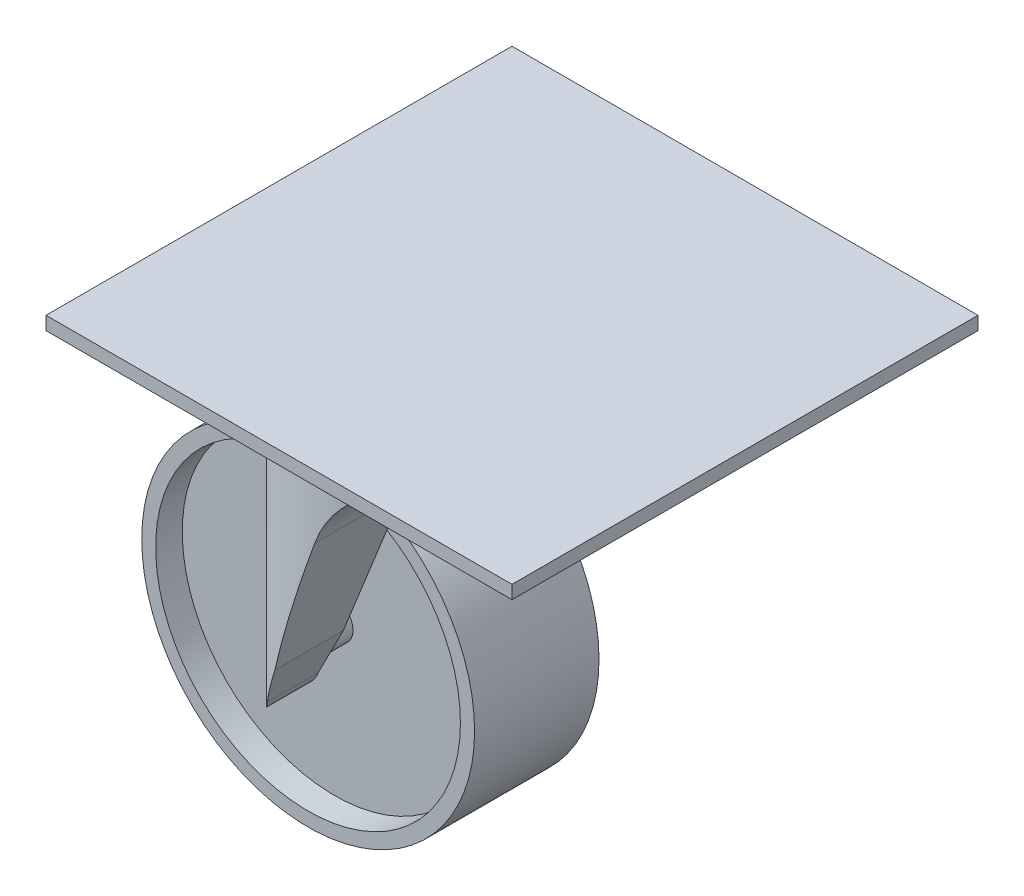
ISO-10303-21;
HEADER;
FILE_DESCRIPTION(('STEP AP214'),'2;1');
FILE_NAME('part.step','',(''),(''),'','','');
FILE_SCHEMA(('AUTOMOTIVE_DESIGN { 1 0 10303 214 1 1 1 1 }'));
ENDSEC;
DATA;
#1=APPLICATION_CONTEXT('core data for automotive mechanical design processes');
#2=APPLICATION_PROTOCOL_DEFINITION('international standard','automotive_design',2000,#1);
#3=PRODUCT_CONTEXT('',#1,'mechanical');
#4=PRODUCT('Part','Part','',(#3));
#5=PRODUCT_RELATED_PRODUCT_CATEGORY('part','',(#4));
#6=PRODUCT_DEFINITION_FORMATION('','',#4);
#7=PRODUCT_DEFINITION_CONTEXT('part definition',#1,'design');
#8=PRODUCT_DEFINITION('design','',#6,#7);
#9=PRODUCT_DEFINITION_SHAPE('','',#8);
#10=(LENGTH_UNIT() NAMED_UNIT(*) SI_UNIT(.MILLI.,.METRE.));
#11=(NAMED_UNIT(*) PLANE_ANGLE_UNIT() SI_UNIT($,.RADIAN.));
#12=(NAMED_UNIT(*) SI_UNIT($,.STERADIAN.) SOLID_ANGLE_UNIT());
#13=UNCERTAINTY_MEASURE_WITH_UNIT(LENGTH_MEASURE(1.E-05),#10,'distance_accuracy_value','');
#14=(GEOMETRIC_REPRESENTATION_CONTEXT(3) GLOBAL_UNCERTAINTY_ASSIGNED_CONTEXT((#13)) GLOBAL_UNIT_ASSIGNED_CONTEXT((#10,
#11,#12)) REPRESENTATION_CONTEXT('',''));
#15=CARTESIAN_POINT('',(0.,0.,0.));
#16=DIRECTION('',(0.,0.,1.));
#17=DIRECTION('',(1.,0.,0.));
#18=AXIS2_PLACEMENT_3D('',#15,#16,#17);
#19=CARTESIAN_POINT('',(35.,-4.63640510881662,-10.9841766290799));
#20=DIRECTION('',(0.,0.,-1.));
#21=DIRECTION('',(0.,1.,0.));
#22=AXIS2_PLACEMENT_3D('',#19,#20,#21);
#23=PLANE('',#22);
#24=DIRECTION('',(0.,1.,0.));
#25=VECTOR('',#24,1.);
#26=CARTESIAN_POINT('',(6.39555851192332,-25.,-10.9841766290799));
#27=LINE('',#26,#25);
#28=CARTESIAN_POINT('',(6.39555851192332,-22.4023650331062,-10.9841766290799));
#29=VERTEX_POINT('',#28);
#30=CARTESIAN_POINT('',(6.39555851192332,-21.486709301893,-10.9841766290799));
#31=VERTEX_POINT('',#30);
#32=EDGE_CURVE('E185',#29,#31,#27,.T.);
#33=ORIENTED_EDGE('',*,*,#32,.T.);
#34=CARTESIAN_POINT('',(7.69587725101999,-21.9445371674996,-10.9841766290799));
#35=DIRECTION('',(0.,0.,-1.));
#36=DIRECTION('',(0.,1.,0.));
#37=AXIS2_PLACEMENT_3D('',#34,#35,#36);
#38=CIRCLE('',#37,1.37856272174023);
#39=EDGE_CURVE('E191',#29,#31,#38,.T.);
#40=ORIENTED_EDGE('',*,*,#39,.F.);
#41=EDGE_LOOP('',(#33,#40));
#42=FACE_BOUND('',#41,.T.);
#43=ADVANCED_FACE('F41',(#42),#23,.F.);
#44=CARTESIAN_POINT('',(7.70636639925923,-21.935380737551,24.3711624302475));
#45=DIRECTION('',(0.,0.,-1.));
#46=DIRECTION('',(-1.,0.,0.));
#47=AXIS2_PLACEMENT_3D('',#44,#45,#46);
#48=CYLINDRICAL_SURFACE('',#47,12.5);
#49=CARTESIAN_POINT('',(7.70636639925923,-21.935380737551,-21.3300622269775));
#50=DIRECTION('',(0.,0.,-1.));
#51=DIRECTION('',(-1.,0.,0.));
#52=AXIS2_PLACEMENT_3D('',#49,#50,#51);
#53=CIRCLE('',#52,12.5);
#54=CARTESIAN_POINT('',(-4.79363360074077,-21.935380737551,-21.3300622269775));
#55=VERTEX_POINT('',#54);
#56=EDGE_CURVE('E293',#55,#55,#53,.T.);
#57=ORIENTED_EDGE('',*,*,#56,.F.);
#58=EDGE_LOOP('',(#57));
#59=FACE_BOUND('',#58,.T.);
#60=CARTESIAN_POINT('',(7.70636639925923,-21.935380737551,-11.9841766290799));
#61=DIRECTION('',(0.,0.,1.));
#62=DIRECTION('',(1.,0.,0.));
#63=AXIS2_PLACEMENT_3D('',#60,#61,#62);
#64=CIRCLE('',#63,12.5);
#65=CARTESIAN_POINT('',(20.2063663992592,-21.935380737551,-11.9841766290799));
#66=VERTEX_POINT('',#65);
#67=EDGE_CURVE('E720',#66,#66,#64,.T.);
#68=ORIENTED_EDGE('',*,*,#67,.F.);
#69=EDGE_LOOP('',(#68));
#70=FACE_BOUND('',#69,.T.);
#71=ADVANCED_FACE('F379',(#59,#70),#48,.T.);
#72=CARTESIAN_POINT('',(17.5,-25.,-16.7236347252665));
#73=DIRECTION('',(0.,1.,0.));
#74=DIRECTION('',(0.,0.,1.));
#75=AXIS2_PLACEMENT_3D('',#72,#73,#74);
#76=CYLINDRICAL_SURFACE('',#75,12.5);
#77=CARTESIAN_POINT('',(17.5,0.,-16.7236347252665));
#78=DIRECTION('',(0.,-1.,0.));
#79=DIRECTION('',(0.,0.,-1.));
#80=AXIS2_PLACEMENT_3D('',#77,#78,#79);
#81=CIRCLE('',#80,12.5);
#82=CARTESIAN_POINT('',(17.5,0.,-29.2236347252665));
#83=VERTEX_POINT('',#82);
#84=EDGE_CURVE('E221',#83,#83,#81,.T.);
#85=ORIENTED_EDGE('',*,*,#84,.T.);
#86=EDGE_LOOP('',(#85));
#87=FACE_BOUND('',#86,.T.);
#88=CARTESIAN_POINT('',(6.39555851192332,-23.9530585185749,-10.9841766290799));
#89=VERTEX_POINT('',#88);
#90=EDGE_CURVE('E174',#89,#29,#27,.T.);
#91=ORIENTED_EDGE('',*,*,#90,.F.);
#92=CARTESIAN_POINT('',(5.65509512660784,-22.1428101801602,-12.7301114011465));
#93=CARTESIAN_POINT('',(5.65034982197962,-22.1776052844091,-12.7441965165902));
#94=CARTESIAN_POINT('',(5.64645610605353,-22.2136446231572,-12.7558195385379));
#95=CARTESIAN_POINT('',(5.64063202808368,-22.287154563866,-12.7732549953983));
#96=CARTESIAN_POINT('',(5.63869746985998,-22.3246219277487,-12.7790798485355));
#97=CARTESIAN_POINT('',(5.63702416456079,-22.4003228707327,-12.7841160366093));
#98=CARTESIAN_POINT('',(5.63729913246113,-22.4385597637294,-12.7832860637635));
#99=CARTESIAN_POINT('',(5.64003305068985,-22.5141627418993,-12.7750651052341));
#100=CARTESIAN_POINT('',(5.64248988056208,-22.5515296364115,-12.7676804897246));
#101=CARTESIAN_POINT('',(5.6500806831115,-22.6326762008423,-12.744994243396));
#102=CARTESIAN_POINT('',(5.65569225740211,-22.6760095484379,-12.7282862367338));
#103=CARTESIAN_POINT('',(5.66914659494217,-22.759386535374,-12.6886192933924));
#104=CARTESIAN_POINT('',(5.67699711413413,-22.7994181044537,-12.6656386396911));
#105=CARTESIAN_POINT('',(5.7010548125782,-22.9057677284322,-12.5960365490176));
#106=CARTESIAN_POINT('',(5.71904544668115,-22.9686238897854,-12.5448262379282));
#107=CARTESIAN_POINT('',(5.75848533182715,-23.086381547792,-12.4352452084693));
#108=CARTESIAN_POINT('',(5.77994432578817,-23.1412597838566,-12.3768544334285));
#109=CARTESIAN_POINT('',(5.83533601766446,-23.267387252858,-12.2298472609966));
#110=CARTESIAN_POINT('',(5.87065397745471,-23.3354742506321,-12.1390658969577));
#111=CARTESIAN_POINT('',(5.94566400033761,-23.4628520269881,-11.9531574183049));
#112=CARTESIAN_POINT('',(5.98536443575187,-23.5221254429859,-11.858022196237));
#113=CARTESIAN_POINT('',(6.06887979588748,-23.6338773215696,-11.6649189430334));
#114=CARTESIAN_POINT('',(6.11271351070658,-23.6863218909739,-11.5669395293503));
#115=CARTESIAN_POINT('',(6.20408261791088,-23.785047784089,-11.369751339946));
#116=CARTESIAN_POINT('',(6.25161526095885,-23.831333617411,-11.2705435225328));
#117=CARTESIAN_POINT('',(6.3757513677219,-23.940737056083,-11.0201792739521));
#118=CARTESIAN_POINT('',(6.45471357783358,-24.0002377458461,-10.8685965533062));
#119=CARTESIAN_POINT('',(6.62082441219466,-24.1068711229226,-10.5654316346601));
#120=CARTESIAN_POINT('',(6.70797901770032,-24.1539946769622,-10.4138495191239));
#121=CARTESIAN_POINT('',(6.88992106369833,-24.2350099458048,-10.112502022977));
#122=CARTESIAN_POINT('',(6.98467891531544,-24.2689502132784,-9.96273198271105));
#123=CARTESIAN_POINT('',(7.18169671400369,-24.3223697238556,-9.66570627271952));
#124=CARTESIAN_POINT('',(7.28395049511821,-24.3418607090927,-9.51844865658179));
#125=CARTESIAN_POINT('',(7.51498671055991,-24.3663148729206,-9.2006792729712));
#126=CARTESIAN_POINT('',(7.64517851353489,-24.367925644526,-9.03090205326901));
#127=CARTESIAN_POINT('',(7.91311886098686,-24.3427019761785,-8.6994911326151));
#128=CARTESIAN_POINT('',(8.05085827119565,-24.3159012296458,-8.53784802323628));
#129=CARTESIAN_POINT('',(8.29412407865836,-24.2384101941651,-8.26631412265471));
#130=CARTESIAN_POINT('',(8.39900057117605,-24.1954626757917,-8.15366318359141));
#131=CARTESIAN_POINT('',(8.60702861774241,-24.086687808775,-7.93800155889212));
#132=CARTESIAN_POINT('',(8.71018188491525,-24.0208847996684,-7.83498076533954));
#133=CARTESIAN_POINT('',(8.88382115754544,-23.8837020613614,-7.66702557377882));
#134=CARTESIAN_POINT('',(8.9559136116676,-23.818054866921,-7.59908980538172));
#135=CARTESIAN_POINT('',(9.09282397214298,-23.6719896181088,-7.4727965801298));
#136=CARTESIAN_POINT('',(9.15766472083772,-23.591620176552,-7.41440876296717));
#137=CARTESIAN_POINT('',(9.26399197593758,-23.4346674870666,-7.32033034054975));
#138=CARTESIAN_POINT('',(9.30752688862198,-23.3608060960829,-7.28244660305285));
#139=CARTESIAN_POINT('',(9.36623216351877,-23.2436561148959,-7.23192803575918));
#140=CARTESIAN_POINT('',(9.38475597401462,-23.2033891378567,-7.21609398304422));
#141=CARTESIAN_POINT('',(9.41929409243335,-23.120937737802,-7.18672205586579));
#142=CARTESIAN_POINT('',(9.43530601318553,-23.0787515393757,-7.1731863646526));
#143=CARTESIAN_POINT('',(9.4499291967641,-23.0357123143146,-7.16087570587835));
#144=B_SPLINE_CURVE_WITH_KNOTS('',3,(#92,#93,#94,#95,#96,#97,#98,#99,#100,#101,#102,#103,#104,
#105,#106,#107,#108,#109,#110,#111,#112,#113,#114,#115,#116,#117,#118,#119,#120,#121,#122,#123,
#124,#125,#126,#127,#128,#129,#130,#131,#132,#133,#134,#135,#136,#137,#138,#139,#140,#141,#142,
#143),.UNSPECIFIED.,.F.,.F.,(4,2,2,2,2,2,2,2,2,2,2,2,2,2,2,2,2,2,2,2,2,2,2,2,2,4),(0.,
0.113592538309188,0.226941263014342,0.340994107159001,0.454936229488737,0.594487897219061,
0.734528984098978,0.982273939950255,1.23072733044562,1.58645581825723,1.94287605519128,
2.30100283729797,2.6588659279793,3.20113425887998,3.74380162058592,4.2844510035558,
4.82466054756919,5.46475129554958,6.10408380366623,6.58195160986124,7.05931207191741,
7.41456032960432,7.768656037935,8.04871541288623,8.18976937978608,8.33095659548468),.UNSPECIFIED.);
#145=CARTESIAN_POINT('',(9.4499291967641,-23.0357123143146,-7.16087570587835));
#146=VERTEX_POINT('',#145);
#147=EDGE_CURVE('E339',#89,#146,#144,.T.);
#148=ORIENTED_EDGE('',*,*,#147,.T.);
#149=CARTESIAN_POINT('',(17.5,-7.29072089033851,-16.7236347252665));
#150=DIRECTION('',(-0.890374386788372,0.455229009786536,0.));
#151=DIRECTION('',(0.455229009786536,0.890374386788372,0.));
#152=AXIS2_PLACEMENT_3D('',#149,#150,#151);
#153=ELLIPSE('',#152,27.4587070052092,12.5);
#154=CARTESIAN_POINT('',(11.3473462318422,-19.3245878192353,-5.84269489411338));
#155=VERTEX_POINT('',#154);
#156=EDGE_CURVE('E342',#146,#155,#153,.T.);
#157=ORIENTED_EDGE('',*,*,#156,.T.);
#158=CARTESIAN_POINT('',(17.5,-3.9523616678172,-16.7236347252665));
#159=DIRECTION('',(-0.928398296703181,0.371586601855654,0.));
#160=DIRECTION('',(0.371586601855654,0.928398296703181,0.));
#161=AXIS2_PLACEMENT_3D('',#158,#159,#160);
#162=ELLIPSE('',#161,33.63953365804,12.5);
#163=CARTESIAN_POINT('',(15.8546728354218,-8.06316364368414,-4.33239190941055));
#164=VERTEX_POINT('',#163);
#165=EDGE_CURVE('E257',#155,#164,#162,.T.);
#166=ORIENTED_EDGE('',*,*,#165,.T.);
#167=CARTESIAN_POINT('',(15.8546728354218,-8.06316364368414,-4.33239190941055));
#168=CARTESIAN_POINT('',(15.9632554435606,-7.79181231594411,-4.31800944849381));
#169=CARTESIAN_POINT('',(16.0827535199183,-7.52482273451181,-4.30355965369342));
#170=CARTESIAN_POINT('',(16.3428077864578,-7.00109031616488,-4.27661777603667));
#171=CARTESIAN_POINT('',(16.4833711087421,-6.74435098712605,-4.26412635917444));
#172=CARTESIAN_POINT('',(16.7856998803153,-6.24117827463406,-4.24313738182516));
#173=CARTESIAN_POINT('',(16.9475987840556,-5.99482384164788,-4.23466664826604));
#174=CARTESIAN_POINT('',(17.2908042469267,-5.51591240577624,-4.22420609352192));
#175=CARTESIAN_POINT('',(17.4721080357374,-5.28335344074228,-4.22221534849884));
#176=CARTESIAN_POINT('',(17.8536154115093,-4.8327740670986,-4.22717609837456));
#177=CARTESIAN_POINT('',(18.0538910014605,-4.61481488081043,-4.23416303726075));
#178=CARTESIAN_POINT('',(18.4710683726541,-4.1961764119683,-4.25965977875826));
#179=CARTESIAN_POINT('',(18.6879678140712,-3.99549470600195,-4.27816796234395));
#180=CARTESIAN_POINT('',(19.135267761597,-3.61394819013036,-4.32902616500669));
#181=CARTESIAN_POINT('',(19.3655992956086,-3.43299383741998,-4.36131006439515));
#182=CARTESIAN_POINT('',(19.8380385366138,-3.09140233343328,-4.44190474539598));
#183=CARTESIAN_POINT('',(20.0801369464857,-2.93074949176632,-4.49020304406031));
#184=CARTESIAN_POINT('',(20.4511155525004,-2.70507424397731,-4.57631869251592));
#185=CARTESIAN_POINT('',(20.5767536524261,-2.63206116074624,-4.60750017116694));
#186=CARTESIAN_POINT('',(20.829876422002,-2.49157576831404,-4.67460652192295));
#187=CARTESIAN_POINT('',(20.9573614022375,-2.4241044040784,-4.71053220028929));
#188=CARTESIAN_POINT('',(21.0855601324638,-2.35944727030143,-4.74892142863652));
#189=B_SPLINE_CURVE_WITH_KNOTS('',3,(#167,#168,#169,#170,#171,#172,#173,#174,#175,#176,#177,
#178,#179,#180,#181,#182,#183,#184,#185,#186,#187,#188),.UNSPECIFIED.,.F.,.F.,(4,2,2,2,2,2,2,2,
2,2,4),(0.,0.877653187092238,1.75560419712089,2.63933350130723,3.52293680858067,
4.41003933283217,5.29701722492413,6.17978492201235,7.06186612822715,7.50756175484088,
7.95333322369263),.UNSPECIFIED.);
#190=CARTESIAN_POINT('',(21.0855601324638,-2.35944727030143,-4.74892142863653));
#191=VERTEX_POINT('',#190);
#192=EDGE_CURVE('E248',#164,#191,#189,.T.);
#193=ORIENTED_EDGE('',*,*,#192,.T.);
#194=CARTESIAN_POINT('',(17.5,-2.50402391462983,-16.7236347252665));
#195=DIRECTION('',(-0.0402891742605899,0.999188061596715,0.));
#196=DIRECTION('',(0.999188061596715,0.0402891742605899,0.));
#197=AXIS2_PLACEMENT_3D('',#194,#195,#196);
#198=ELLIPSE('',#197,12.510157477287,12.5);
#199=CARTESIAN_POINT('',(21.0855601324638,-2.35944727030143,-28.6983480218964));
#200=VERTEX_POINT('',#199);
#201=EDGE_CURVE('E224',#191,#200,#198,.T.);
#202=ORIENTED_EDGE('',*,*,#201,.T.);
#203=CARTESIAN_POINT('',(21.0855601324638,-2.35944727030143,-28.6983480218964));
#204=CARTESIAN_POINT('',(20.9677017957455,-2.41889013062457,-28.733640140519));
#205=CARTESIAN_POINT('',(20.8504450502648,-2.480711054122,-28.7668515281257));
#206=CARTESIAN_POINT('',(20.6174534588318,-2.60904972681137,-28.8292541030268));
#207=CARTESIAN_POINT('',(20.5017184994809,-2.67556712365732,-28.8584455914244));
#208=CARTESIAN_POINT('',(20.1574813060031,-2.88194906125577,-28.9401541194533));
#209=CARTESIAN_POINT('',(19.9317059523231,-3.02876439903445,-28.9868763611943));
#210=CARTESIAN_POINT('',(19.4912204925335,-3.33911737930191,-29.0660372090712));
#211=CARTESIAN_POINT('',(19.2764586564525,-3.50256347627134,-29.0985492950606));
#212=CARTESIAN_POINT('',(18.8587250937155,-3.84572482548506,-29.1513535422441));
#213=CARTESIAN_POINT('',(18.65575488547,-4.02544216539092,-29.1716441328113));
#214=CARTESIAN_POINT('',(18.2638394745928,-4.3993953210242,-29.201819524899));
#215=CARTESIAN_POINT('',(18.0748606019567,-4.5935938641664,-29.211730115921));
#216=CARTESIAN_POINT('',(17.7117232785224,-4.9956174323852,-29.2231619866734));
#217=CARTESIAN_POINT('',(17.5375658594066,-5.20344340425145,-29.2246826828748));
#218=CARTESIAN_POINT('',(17.2051262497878,-5.63148643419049,-29.2212625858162));
#219=CARTESIAN_POINT('',(17.0468503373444,-5.85170833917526,-29.2163192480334));
#220=CARTESIAN_POINT('',(16.7471923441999,-6.30311439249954,-29.2018466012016));
#221=CARTESIAN_POINT('',(16.6058050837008,-6.53429514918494,-29.1923187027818));
#222=CARTESIAN_POINT('',(16.355977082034,-6.97905702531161,-29.1717301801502));
#223=CARTESIAN_POINT('',(16.245617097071,-7.19157800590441,-29.1609746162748));
#224=CARTESIAN_POINT('',(16.0393298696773,-7.62282625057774,-29.1384272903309));
#225=CARTESIAN_POINT('',(15.9433683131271,-7.84153723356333,-29.1266381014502));
#226=CARTESIAN_POINT('',(15.8546728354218,-8.06316364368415,-29.1148775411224));
#227=B_SPLINE_CURVE_WITH_KNOTS('',3,(#203,#204,#205,#206,#207,#208,#209,#210,#211,#212,#213,
#214,#215,#216,#217,#218,#219,#220,#221,#222,#223,#224,#225,#226),.UNSPECIFIED.,.F.,.F.,(4,2,2,
2,2,2,2,2,2,2,2,4),(0.,0.409830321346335,0.819629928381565,1.63839615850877,2.4528770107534,
3.26746251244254,4.0800193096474,4.89263262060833,5.70556590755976,6.51824922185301,
7.23686619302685,7.9537423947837),.UNSPECIFIED.);
#228=CARTESIAN_POINT('',(15.8546728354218,-8.06316364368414,-29.1148775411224));
#229=VERTEX_POINT('',#228);
#230=EDGE_CURVE('E273',#200,#229,#227,.T.);
#231=ORIENTED_EDGE('',*,*,#230,.T.);
#232=CARTESIAN_POINT('',(11.3473462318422,-19.3245878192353,-27.6045745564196));
#233=VERTEX_POINT('',#232);
#234=EDGE_CURVE('E282',#229,#233,#162,.T.);
#235=ORIENTED_EDGE('',*,*,#234,.T.);
#236=CARTESIAN_POINT('',(9.4499291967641,-23.0357123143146,-26.2863937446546));
#237=VERTEX_POINT('',#236);
#238=EDGE_CURVE('E345',#233,#237,#153,.T.);
#239=ORIENTED_EDGE('',*,*,#238,.T.);
#240=CARTESIAN_POINT('',(9.4499291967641,-23.0357123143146,-26.2863937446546));
#241=CARTESIAN_POINT('',(9.43314192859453,-23.0851382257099,-26.2722611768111));
#242=CARTESIAN_POINT('',(9.41451234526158,-23.1334437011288,-26.256503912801));
#243=CARTESIAN_POINT('',(9.37399189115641,-23.2274753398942,-26.22198738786));
#244=CARTESIAN_POINT('',(9.35210506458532,-23.2732046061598,-26.2032318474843));
#245=CARTESIAN_POINT('',(9.30565593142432,-23.3614774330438,-26.1631079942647));
#246=CARTESIAN_POINT('',(9.28111892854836,-23.4040455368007,-26.141764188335));
#247=CARTESIAN_POINT('',(9.22961114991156,-23.486276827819,-26.0965663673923));
#248=CARTESIAN_POINT('',(9.20263966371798,-23.5259391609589,-26.0727116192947));
#249=CARTESIAN_POINT('',(9.11893591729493,-23.6400075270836,-25.9979705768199));
#250=CARTESIAN_POINT('',(9.05914245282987,-23.7099975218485,-25.9436750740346));
#251=CARTESIAN_POINT('',(8.93408670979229,-23.8380485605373,-25.8276153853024));
#252=CARTESIAN_POINT('',(8.86881070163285,-23.8960783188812,-25.7658322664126));
#253=CARTESIAN_POINT('',(8.69825850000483,-24.0294208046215,-25.6005735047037));
#254=CARTESIAN_POINT('',(8.59074582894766,-24.096659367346,-25.4928709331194));
#255=CARTESIAN_POINT('',(8.37409534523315,-24.2067141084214,-25.2671985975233));
#256=CARTESIAN_POINT('',(8.26495491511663,-24.2494852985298,-25.1492103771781));
#257=CARTESIAN_POINT('',(8.07762521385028,-24.3055046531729,-24.9384473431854));
#258=CARTESIAN_POINT('',(7.99893689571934,-24.3235825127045,-24.8473302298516));
#259=CARTESIAN_POINT('',(7.84353547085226,-24.3497793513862,-24.6619794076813));
#260=CARTESIAN_POINT('',(7.76682330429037,-24.3578936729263,-24.5677442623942));
#261=CARTESIAN_POINT('',(7.61591798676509,-24.3652769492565,-24.3767236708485));
#262=CARTESIAN_POINT('',(7.54172917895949,-24.3645313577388,-24.2799342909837));
#263=CARTESIAN_POINT('',(7.39638711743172,-24.3551102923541,-24.0844669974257));
#264=CARTESIAN_POINT('',(7.32523474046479,-24.3464325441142,-23.985788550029));
#265=CARTESIAN_POINT('',(7.1562209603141,-24.316640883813,-23.7440601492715));
#266=CARTESIAN_POINT('',(7.0600950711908,-24.2917747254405,-23.6002516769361));
#267=CARTESIAN_POINT('',(6.87505933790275,-24.2291160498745,-23.3107572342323));
#268=CARTESIAN_POINT('',(6.78615386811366,-24.1913157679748,-23.1650701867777));
#269=CARTESIAN_POINT('',(6.61581227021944,-24.1038242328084,-22.8728677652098));
#270=CARTESIAN_POINT('',(6.53437812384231,-24.0541298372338,-22.7263521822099));
#271=CARTESIAN_POINT('',(6.37919393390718,-23.94319269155,-22.4337179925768));
#272=CARTESIAN_POINT('',(6.30543894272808,-23.8819574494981,-22.2875991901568));
#273=CARTESIAN_POINT('',(6.2009804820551,-23.7811101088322,-22.0704620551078));
#274=CARTESIAN_POINT('',(6.16730454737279,-23.7461425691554,-21.9986878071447));
#275=CARTESIAN_POINT('',(6.10194249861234,-23.6729054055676,-21.8559285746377));
#276=CARTESIAN_POINT('',(6.07025601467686,-23.6346363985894,-21.7849434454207));
#277=CARTESIAN_POINT('',(6.00903782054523,-23.5545126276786,-21.644371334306));
#278=CARTESIAN_POINT('',(5.97950026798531,-23.5126683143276,-21.5747809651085));
#279=CARTESIAN_POINT('',(5.92263209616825,-23.42469392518,-21.4374511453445));
#280=CARTESIAN_POINT('',(5.8953004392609,-23.3785658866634,-21.3697108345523));
#281=CARTESIAN_POINT('',(5.84594860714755,-23.2863729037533,-21.2443772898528));
#282=CARTESIAN_POINT('',(5.82367454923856,-23.2408543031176,-21.1864852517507));
#283=CARTESIAN_POINT('',(5.78136761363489,-23.1444801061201,-21.0741801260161));
#284=CARTESIAN_POINT('',(5.76133790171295,-23.0936171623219,-21.019771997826));
#285=CARTESIAN_POINT('',(5.7268983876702,-22.9929341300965,-20.9243809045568));
#286=CARTESIAN_POINT('',(5.71209471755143,-22.9440240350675,-20.8825938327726));
#287=CARTESIAN_POINT('',(5.68544564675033,-22.8400691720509,-20.8062712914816));
#288=CARTESIAN_POINT('',(5.67359029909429,-22.785045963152,-20.7717115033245));
#289=CARTESIAN_POINT('',(5.6581900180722,-22.6923746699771,-20.7263664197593));
#290=CARTESIAN_POINT('',(5.6532337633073,-22.6569116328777,-20.7116529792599));
#291=CARTESIAN_POINT('',(5.64518905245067,-22.5840086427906,-20.6876752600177));
#292=CARTESIAN_POINT('',(5.64209661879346,-22.5465730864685,-20.6783993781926));
#293=CARTESIAN_POINT('',(5.63807758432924,-22.4702055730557,-20.6663294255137));
#294=CARTESIAN_POINT('',(5.63716888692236,-22.4312638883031,-20.6635889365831));
#295=CARTESIAN_POINT('',(5.63769303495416,-22.3534670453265,-20.6651666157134));
#296=CARTESIAN_POINT('',(5.63912971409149,-22.3146121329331,-20.6694963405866));
#297=CARTESIAN_POINT('',(5.64315977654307,-22.2535427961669,-20.6815836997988));
#298=CARTESIAN_POINT('',(5.64506781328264,-22.2308441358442,-20.6872989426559));
#299=CARTESIAN_POINT('',(5.64958036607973,-22.1862317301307,-20.7007699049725));
#300=CARTESIAN_POINT('',(5.65218196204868,-22.1643151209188,-20.708517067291));
#301=CARTESIAN_POINT('',(5.65509512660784,-22.1428101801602,-20.7171580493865));
#302=B_SPLINE_CURVE_WITH_KNOTS('',3,(#240,#241,#242,#243,#244,#245,#246,#247,#248,#249,#250,
#251,#252,#253,#254,#255,#256,#257,#258,#259,#260,#261,#262,#263,#264,#265,#266,#267,#268,#269,
#270,#271,#272,#273,#274,#275,#276,#277,#278,#279,#280,#281,#282,#283,#284,#285,#286,#287,#288,
#289,#290,#291,#292,#293,#294,#295,#296,#297,#298,#299,#300,#301),.UNSPECIFIED.,.F.,.F.,(4,2,2,
2,2,2,2,2,2,2,2,2,2,2,2,2,2,2,2,2,2,2,2,2,2,2,2,2,2,2,4),(0.,0.162127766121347,
0.324055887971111,0.484555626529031,0.645102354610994,0.964367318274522,1.28445710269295,
1.78077352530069,2.27799961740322,2.64275080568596,3.00767243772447,3.37319328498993,
3.73881897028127,4.26234311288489,4.78618209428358,5.31015962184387,5.8337974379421,
6.09367996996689,6.35351404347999,6.61261303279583,6.87158942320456,7.10220362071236,
7.33313912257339,7.53072719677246,7.72763932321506,7.84339733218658,7.95890742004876,
8.07536133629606,8.19200579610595,8.26235756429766,8.33241768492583),.UNSPECIFIED.);
#303=CARTESIAN_POINT('',(6.327803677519,-23.8980492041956,-22.3300622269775));
#304=VERTEX_POINT('',#303);
#305=EDGE_CURVE('E283',#237,#304,#302,.T.);
#306=ORIENTED_EDGE('',*,*,#305,.T.);
#307=DIRECTION('',(0.,1.,0.));
#308=VECTOR('',#307,1.);
#309=CARTESIAN_POINT('',(6.327803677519,-25.,-22.3300622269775));
#310=LINE('',#309,#308);
#311=CARTESIAN_POINT('',(6.327803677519,-21.935380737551,-22.3300622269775));
#312=VERTEX_POINT('',#311);
#313=EDGE_CURVE('E298',#304,#312,#310,.T.);
#314=ORIENTED_EDGE('',*,*,#313,.T.);
#315=DIRECTION('',(0.,1.,0.));
#316=VECTOR('',#315,1.);
#317=CARTESIAN_POINT('',(6.327803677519,-25.,-22.3300622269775));
#318=LINE('',#317,#316);
#319=CARTESIAN_POINT('',(6.327803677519,-17.1745772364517,-22.3300622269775));
#320=VERTEX_POINT('',#319);
#321=EDGE_CURVE('E324',#320,#312,#318,.F.);
#322=ORIENTED_EDGE('',*,*,#321,.F.);
#323=CARTESIAN_POINT('',(17.5,65.3367476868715,-16.7236347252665));
#324=DIRECTION('',(0.990957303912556,-0.134177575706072,0.));
#325=DIRECTION('',(0.134177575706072,0.990957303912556,0.));
#326=AXIS2_PLACEMENT_3D('',#323,#324,#325);
#327=ELLIPSE('',#326,93.1601270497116,12.5);
#328=CARTESIAN_POINT('',(8.33380152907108,-2.35944727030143,-25.2225055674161));
#329=VERTEX_POINT('',#328);
#330=EDGE_CURVE('E351',#320,#329,#327,.T.);
#331=ORIENTED_EDGE('',*,*,#330,.T.);
#332=CARTESIAN_POINT('',(17.5,-2.35944727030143,-16.7236347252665));
#333=DIRECTION('',(0.,1.,0.));
#334=DIRECTION('',(0.,0.,1.));
#335=AXIS2_PLACEMENT_3D('',#332,#333,#334);
#336=CIRCLE('',#335,12.5);
#337=CARTESIAN_POINT('',(8.33380152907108,-2.35944727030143,-8.22476388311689));
#338=VERTEX_POINT('',#337);
#339=EDGE_CURVE('E352',#329,#338,#336,.T.);
#340=ORIENTED_EDGE('',*,*,#339,.T.);
#341=CARTESIAN_POINT('',(6.39555851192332,-16.6741795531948,-10.9841766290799));
#342=VERTEX_POINT('',#341);
#343=EDGE_CURVE('E346',#338,#342,#327,.T.);
#344=ORIENTED_EDGE('',*,*,#343,.T.);
#345=EDGE_CURVE('E187',#31,#342,#27,.T.);
#346=ORIENTED_EDGE('',*,*,#345,.F.);
#347=ORIENTED_EDGE('',*,*,#32,.F.);
#348=EDGE_LOOP('',(#91,#148,#157,#166,#193,#202,#231,#235,#239,#306,#314,#322,#331,#340,#344,
#346,#347));
#349=FACE_BOUND('',#348,.T.);
#350=ADVANCED_FACE('F196',(#87,#349),#76,.T.);
#351=CARTESIAN_POINT('',(8.33380152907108,-2.35944727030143,-35.));
#352=DIRECTION('',(0.990957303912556,-0.134177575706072,0.));
#353=DIRECTION('',(0.134177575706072,0.990957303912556,0.));
#354=AXIS2_PLACEMENT_3D('',#351,#352,#353);
#355=PLANE('',#354);
#356=DIRECTION('',(0.134177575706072,0.990957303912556,0.));
#357=VECTOR('',#356,1.);
#358=CARTESIAN_POINT('',(8.33380152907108,-2.35944727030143,-10.9841766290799));
#359=LINE('',#358,#357);
#360=CARTESIAN_POINT('',(8.02549694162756,-4.63640510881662,-10.9841766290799));
#361=VERTEX_POINT('',#360);
#362=EDGE_CURVE('E184',#342,#361,#359,.T.);
#363=ORIENTED_EDGE('',*,*,#362,.F.);
#364=ORIENTED_EDGE('',*,*,#343,.F.);
#365=DIRECTION('',(0.,0.,1.));
#366=VECTOR('',#365,1.);
#367=CARTESIAN_POINT('',(8.33380152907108,-2.35944727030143,-35.));
#368=LINE('',#367,#366);
#369=EDGE_CURVE('E203',#329,#338,#368,.T.);
#370=ORIENTED_EDGE('',*,*,#369,.F.);
#371=ORIENTED_EDGE('',*,*,#330,.F.);
#372=DIRECTION('',(-0.134177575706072,-0.990957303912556,0.));
#373=VECTOR('',#372,1.);
#374=CARTESIAN_POINT('',(8.33380152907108,-2.35944727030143,-22.3300622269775));
#375=LINE('',#374,#373);
#376=CARTESIAN_POINT('',(8.02549694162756,-4.63640510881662,-22.3300622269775));
#377=VERTEX_POINT('',#376);
#378=EDGE_CURVE('E326',#377,#320,#375,.T.);
#379=ORIENTED_EDGE('',*,*,#378,.F.);
#380=DIRECTION('',(0.,0.,-1.));
#381=VECTOR('',#380,1.);
#382=CARTESIAN_POINT('',(8.02549694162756,-4.63640510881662,-35.));
#383=LINE('',#382,#381);
#384=EDGE_CURVE('E316',#361,#377,#383,.T.);
#385=ORIENTED_EDGE('',*,*,#384,.F.);
#386=EDGE_LOOP('',(#363,#364,#370,#371,#379,#385));
#387=FACE_BOUND('',#386,.T.);
#388=ADVANCED_FACE('F361',(#387),#355,.F.);
#389=CARTESIAN_POINT('',(7.59573215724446,-22.4055762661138,-35.));
#390=DIRECTION('',(0.,0.,1.));
#391=DIRECTION('',(1.,0.,0.));
#392=AXIS2_PLACEMENT_3D('',#389,#390,#391);
#393=CYLINDRICAL_SURFACE('',#392,1.95834575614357);
#394=CARTESIAN_POINT('',(7.59573215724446,-22.4055762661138,-10.9841766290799));
#395=DIRECTION('',(0.,0.,-1.));
#396=DIRECTION('',(0.,1.,0.));
#397=AXIS2_PLACEMENT_3D('',#394,#395,#396);
#398=CIRCLE('',#397,1.95834575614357);
#399=CARTESIAN_POINT('',(9.4499291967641,-23.0357123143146,-10.9841766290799));
#400=VERTEX_POINT('',#399);
#401=EDGE_CURVE('E180',#400,#89,#398,.T.);
#402=ORIENTED_EDGE('',*,*,#401,.F.);
#403=DIRECTION('',(0.,0.,1.));
#404=VECTOR('',#403,1.);
#405=CARTESIAN_POINT('',(9.4499291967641,-23.0357123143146,-35.));
#406=LINE('',#405,#404);
#407=EDGE_CURVE('E210',#400,#146,#406,.T.);
#408=ORIENTED_EDGE('',*,*,#407,.T.);
#409=ORIENTED_EDGE('',*,*,#147,.F.);
#410=EDGE_LOOP('',(#402,#408,#409));
#411=FACE_BOUND('',#410,.T.);
#412=ADVANCED_FACE('F337',(#411),#393,.T.);
#413=CARTESIAN_POINT('',(7.59573215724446,-22.4055762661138,-22.3300622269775));
#414=DIRECTION('',(0.,0.,1.));
#415=DIRECTION('',(1.,0.,0.));
#416=AXIS2_PLACEMENT_3D('',#413,#414,#415);
#417=CIRCLE('',#416,1.95834575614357);
#418=CARTESIAN_POINT('',(9.4499291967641,-23.0357123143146,-22.3300622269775));
#419=VERTEX_POINT('',#418);
#420=EDGE_CURVE('E322',#304,#419,#417,.T.);
#421=ORIENTED_EDGE('',*,*,#420,.F.);
#422=ORIENTED_EDGE('',*,*,#305,.F.);
#423=EDGE_CURVE('E207',#237,#419,#406,.T.);
#424=ORIENTED_EDGE('',*,*,#423,.T.);
#425=EDGE_LOOP('',(#421,#422,#424));
#426=FACE_BOUND('',#425,.T.);
#427=ADVANCED_FACE('F561',(#426),#393,.T.);
#428=CARTESIAN_POINT('',(9.4499291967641,-23.0357123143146,-35.));
#429=DIRECTION('',(-0.890374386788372,0.455229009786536,0.));
#430=DIRECTION('',(-0.455229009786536,-0.890374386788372,0.));
#431=AXIS2_PLACEMENT_3D('',#428,#429,#430);
#432=PLANE('',#431);
#433=DIRECTION('',(-0.455229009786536,-0.890374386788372,0.));
#434=VECTOR('',#433,1.);
#435=CARTESIAN_POINT('',(9.4499291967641,-23.0357123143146,-10.9841766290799));
#436=LINE('',#435,#434);
#437=CARTESIAN_POINT('',(11.3473462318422,-19.3245878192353,-10.9841766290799));
#438=VERTEX_POINT('',#437);
#439=EDGE_CURVE('E329',#438,#400,#436,.T.);
#440=ORIENTED_EDGE('',*,*,#439,.F.);
#441=DIRECTION('',(0.,0.,1.));
#442=VECTOR('',#441,1.);
#443=CARTESIAN_POINT('',(11.3473462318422,-19.3245878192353,-35.));
#444=LINE('',#443,#442);
#445=EDGE_CURVE('E214',#438,#155,#444,.T.);
#446=ORIENTED_EDGE('',*,*,#445,.T.);
#447=ORIENTED_EDGE('',*,*,#156,.F.);
#448=ORIENTED_EDGE('',*,*,#407,.F.);
#449=EDGE_LOOP('',(#440,#446,#447,#448));
#450=FACE_BOUND('',#449,.T.);
#451=ADVANCED_FACE('F340',(#450),#432,.F.);
#452=DIRECTION('',(0.455229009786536,0.890374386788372,0.));
#453=VECTOR('',#452,1.);
#454=CARTESIAN_POINT('',(9.4499291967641,-23.0357123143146,-22.3300622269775));
#455=LINE('',#454,#453);
#456=CARTESIAN_POINT('',(11.3473462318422,-19.3245878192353,-22.3300622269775));
#457=VERTEX_POINT('',#456);
#458=EDGE_CURVE('E320',#419,#457,#455,.T.);
#459=ORIENTED_EDGE('',*,*,#458,.F.);
#460=ORIENTED_EDGE('',*,*,#423,.F.);
#461=ORIENTED_EDGE('',*,*,#238,.F.);
#462=EDGE_CURVE('E211',#233,#457,#444,.T.);
#463=ORIENTED_EDGE('',*,*,#462,.T.);
#464=EDGE_LOOP('',(#459,#460,#461,#463));
#465=FACE_BOUND('',#464,.T.);
#466=ADVANCED_FACE('F578',(#465),#432,.F.);
#467=CARTESIAN_POINT('',(11.3473462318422,-19.3245878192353,-35.));
#468=DIRECTION('',(-0.928398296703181,0.371586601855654,0.));
#469=DIRECTION('',(-0.371586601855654,-0.928398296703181,0.));
#470=AXIS2_PLACEMENT_3D('',#467,#468,#469);
#471=PLANE('',#470);
#472=DIRECTION('',(-0.371586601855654,-0.928398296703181,0.));
#473=VECTOR('',#472,1.);
#474=CARTESIAN_POINT('',(11.3473462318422,-19.3245878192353,-10.9841766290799));
#475=LINE('',#474,#473);
#476=CARTESIAN_POINT('',(15.8546728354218,-8.06316364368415,-10.9841766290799));
#477=VERTEX_POINT('',#476);
#478=EDGE_CURVE('E328',#477,#438,#475,.T.);
#479=ORIENTED_EDGE('',*,*,#478,.F.);
#480=DIRECTION('',(0.,0.,1.));
#481=VECTOR('',#480,1.);
#482=CARTESIAN_POINT('',(15.8546728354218,-8.06316364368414,-35.));
#483=LINE('',#482,#481);
#484=EDGE_CURVE('E218',#477,#164,#483,.T.);
#485=ORIENTED_EDGE('',*,*,#484,.T.);
#486=ORIENTED_EDGE('',*,*,#165,.F.);
#487=ORIENTED_EDGE('',*,*,#445,.F.);
#488=EDGE_LOOP('',(#479,#485,#486,#487));
#489=FACE_BOUND('',#488,.T.);
#490=ADVANCED_FACE('F268',(#489),#471,.F.);
#491=DIRECTION('',(0.371586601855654,0.928398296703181,0.));
#492=VECTOR('',#491,1.);
#493=CARTESIAN_POINT('',(11.3473462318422,-19.3245878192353,-22.3300622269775));
#494=LINE('',#493,#492);
#495=CARTESIAN_POINT('',(15.8546728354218,-8.06316364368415,-22.3300622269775));
#496=VERTEX_POINT('',#495);
#497=EDGE_CURVE('E318',#457,#496,#494,.T.);
#498=ORIENTED_EDGE('',*,*,#497,.F.);
#499=ORIENTED_EDGE('',*,*,#462,.F.);
#500=ORIENTED_EDGE('',*,*,#234,.F.);
#501=EDGE_CURVE('E215',#229,#496,#483,.T.);
#502=ORIENTED_EDGE('',*,*,#501,.T.);
#503=EDGE_LOOP('',(#498,#499,#500,#502));
#504=FACE_BOUND('',#503,.T.);
#505=ADVANCED_FACE('F266',(#504),#471,.F.);
#506=CARTESIAN_POINT('',(26.0131655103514,-12.1290476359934,-35.));
#507=DIRECTION('',(0.,0.,1.));
#508=DIRECTION('',(1.,0.,0.));
#509=AXIS2_PLACEMENT_3D('',#506,#507,#508);
#510=CYLINDRICAL_SURFACE('',#509,10.9419553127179);
#511=CARTESIAN_POINT('',(26.0131655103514,-12.1290476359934,-10.9841766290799));
#512=DIRECTION('',(0.,0.,-1.));
#513=DIRECTION('',(0.,1.,0.));
#514=AXIS2_PLACEMENT_3D('',#511,#512,#513);
#515=CIRCLE('',#514,10.9419553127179);
#516=CARTESIAN_POINT('',(18.0390389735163,-4.63640510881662,-10.9841766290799));
#517=VERTEX_POINT('',#516);
#518=EDGE_CURVE('E11',#517,#477,#515,.F.);
#519=ORIENTED_EDGE('',*,*,#518,.F.);
#520=DIRECTION('',(0.,0.,1.));
#521=VECTOR('',#520,1.);
#522=CARTESIAN_POINT('',(18.0390389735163,-4.63640510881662,-35.));
#523=LINE('',#522,#521);
#524=CARTESIAN_POINT('',(18.0390389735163,-4.63640510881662,-22.3300622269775));
#525=VERTEX_POINT('',#524);
#526=EDGE_CURVE('E281',#525,#517,#523,.T.);
#527=ORIENTED_EDGE('',*,*,#526,.F.);
#528=CARTESIAN_POINT('',(26.0131655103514,-12.1290476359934,-22.3300622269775));
#529=DIRECTION('',(0.,0.,1.));
#530=DIRECTION('',(1.,0.,0.));
#531=AXIS2_PLACEMENT_3D('',#528,#529,#530);
#532=CIRCLE('',#531,10.9419553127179);
#533=EDGE_CURVE('E50',#496,#525,#532,.F.);
#534=ORIENTED_EDGE('',*,*,#533,.F.);
#535=ORIENTED_EDGE('',*,*,#501,.F.);
#536=ORIENTED_EDGE('',*,*,#230,.F.);
#537=DIRECTION('',(0.,0.,1.));
#538=VECTOR('',#537,1.);
#539=CARTESIAN_POINT('',(21.0855601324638,-2.35944727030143,-35.));
#540=LINE('',#539,#538);
#541=EDGE_CURVE('E202',#200,#191,#540,.T.);
#542=ORIENTED_EDGE('',*,*,#541,.T.);
#543=ORIENTED_EDGE('',*,*,#192,.F.);
#544=ORIENTED_EDGE('',*,*,#484,.F.);
#545=EDGE_LOOP('',(#519,#527,#534,#535,#536,#542,#543,#544));
#546=FACE_BOUND('',#545,.T.);
#547=ADVANCED_FACE('F262',(#546),#510,.F.);
#548=CARTESIAN_POINT('',(0.,1.,0.));
#549=DIRECTION('',(1.,0.,0.));
#550=DIRECTION('',(0.,0.,-1.));
#551=AXIS2_PLACEMENT_3D('',#548,#549,#550);
#552=PLANE('',#551);
#553=DIRECTION('',(0.,0.,1.));
#554=VECTOR('',#553,1.);
#555=CARTESIAN_POINT('',(0.,0.,0.));
#556=LINE('',#555,#554);
#557=CARTESIAN_POINT('',(0.,0.,-35.));
#558=VERTEX_POINT('',#557);
#559=CARTESIAN_POINT('',(0.,0.,0.));
#560=VERTEX_POINT('',#559);
#561=EDGE_CURVE('E206',#558,#560,#556,.T.);
#562=ORIENTED_EDGE('',*,*,#561,.T.);
#563=DIRECTION('',(0.,-1.,0.));
#564=VECTOR('',#563,1.);
#565=CARTESIAN_POINT('',(0.,1.,0.));
#566=LINE('',#565,#564);
#567=CARTESIAN_POINT('',(0.,1.,0.));
#568=VERTEX_POINT('',#567);
#569=EDGE_CURVE('E225',#568,#560,#566,.T.);
#570=ORIENTED_EDGE('',*,*,#569,.F.);
#571=DIRECTION('',(0.,0.,1.));
#572=VECTOR('',#571,1.);
#573=CARTESIAN_POINT('',(0.,1.,0.));
#574=LINE('',#573,#572);
#575=CARTESIAN_POINT('',(0.,1.,-35.));
#576=VERTEX_POINT('',#575);
#577=EDGE_CURVE('E226',#576,#568,#574,.T.);
#578=ORIENTED_EDGE('',*,*,#577,.F.);
#579=DIRECTION('',(0.,-1.,0.));
#580=VECTOR('',#579,1.);
#581=CARTESIAN_POINT('',(0.,1.,-35.));
#582=LINE('',#581,#580);
#583=EDGE_CURVE('E232',#576,#558,#582,.T.);
#584=ORIENTED_EDGE('',*,*,#583,.T.);
#585=EDGE_LOOP('',(#562,#570,#578,#584));
#586=FACE_BOUND('',#585,.T.);
#587=ADVANCED_FACE('F43',(#586),#552,.F.);
#588=CARTESIAN_POINT('',(0.,1.,0.));
#589=DIRECTION('',(0.,0.,-1.));
#590=DIRECTION('',(-1.,0.,0.));
#591=AXIS2_PLACEMENT_3D('',#588,#589,#590);
#592=PLANE('',#591);
#593=DIRECTION('',(1.,0.,0.));
#594=VECTOR('',#593,1.);
#595=CARTESIAN_POINT('',(0.,0.,0.));
#596=LINE('',#595,#594);
#597=CARTESIAN_POINT('',(35.,0.,0.));
#598=VERTEX_POINT('',#597);
#599=EDGE_CURVE('E235',#560,#598,#596,.T.);
#600=ORIENTED_EDGE('',*,*,#599,.T.);
#601=DIRECTION('',(0.,-1.,0.));
#602=VECTOR('',#601,1.);
#603=CARTESIAN_POINT('',(35.,1.,0.));
#604=LINE('',#603,#602);
#605=CARTESIAN_POINT('',(35.,1.,0.));
#606=VERTEX_POINT('',#605);
#607=EDGE_CURVE('E243',#606,#598,#604,.T.);
#608=ORIENTED_EDGE('',*,*,#607,.F.);
#609=DIRECTION('',(1.,0.,0.));
#610=VECTOR('',#609,1.);
#611=CARTESIAN_POINT('',(0.,1.,0.));
#612=LINE('',#611,#610);
#613=EDGE_CURVE('E96',#568,#606,#612,.T.);
#614=ORIENTED_EDGE('',*,*,#613,.F.);
#615=ORIENTED_EDGE('',*,*,#569,.T.);
#616=EDGE_LOOP('',(#600,#608,#614,#615));
#617=FACE_BOUND('',#616,.T.);
#618=ADVANCED_FACE('F649',(#617),#592,.F.);
#619=CARTESIAN_POINT('',(35.,1.,0.));
#620=DIRECTION('',(-1.,0.,0.));
#621=DIRECTION('',(0.,0.,1.));
#622=AXIS2_PLACEMENT_3D('',#619,#620,#621);
#623=PLANE('',#622);
#624=DIRECTION('',(0.,0.,-1.));
#625=VECTOR('',#624,1.);
#626=CARTESIAN_POINT('',(35.,0.,0.));
#627=LINE('',#626,#625);
#628=CARTESIAN_POINT('',(35.,0.,-35.));
#629=VERTEX_POINT('',#628);
#630=EDGE_CURVE('E237',#598,#629,#627,.T.);
#631=ORIENTED_EDGE('',*,*,#630,.T.);
#632=DIRECTION('',(0.,-1.,0.));
#633=VECTOR('',#632,1.);
#634=CARTESIAN_POINT('',(35.,1.,-35.));
#635=LINE('',#634,#633);
#636=CARTESIAN_POINT('',(35.,1.,-35.));
#637=VERTEX_POINT('',#636);
#638=EDGE_CURVE('E241',#637,#629,#635,.T.);
#639=ORIENTED_EDGE('',*,*,#638,.F.);
#640=DIRECTION('',(0.,0.,-1.));
#641=VECTOR('',#640,1.);
#642=CARTESIAN_POINT('',(35.,1.,0.));
#643=LINE('',#642,#641);
#644=EDGE_CURVE('E229',#606,#637,#643,.T.);
#645=ORIENTED_EDGE('',*,*,#644,.F.);
#646=ORIENTED_EDGE('',*,*,#607,.T.);
#647=EDGE_LOOP('',(#631,#639,#645,#646));
#648=FACE_BOUND('',#647,.T.);
#649=ADVANCED_FACE('F640',(#648),#623,.F.);
#650=CARTESIAN_POINT('',(0.,1.,-35.));
#651=DIRECTION('',(0.,0.,1.));
#652=DIRECTION('',(1.,0.,0.));
#653=AXIS2_PLACEMENT_3D('',#650,#651,#652);
#654=PLANE('',#653);
#655=DIRECTION('',(-1.,0.,0.));
#656=VECTOR('',#655,1.);
#657=CARTESIAN_POINT('',(0.,0.,-35.));
#658=LINE('',#657,#656);
#659=EDGE_CURVE('E88',#629,#558,#658,.T.);
#660=ORIENTED_EDGE('',*,*,#659,.T.);
#661=ORIENTED_EDGE('',*,*,#583,.F.);
#662=DIRECTION('',(-1.,0.,0.));
#663=VECTOR('',#662,1.);
#664=CARTESIAN_POINT('',(0.,1.,-35.));
#665=LINE('',#664,#663);
#666=EDGE_CURVE('E67',#637,#576,#665,.T.);
#667=ORIENTED_EDGE('',*,*,#666,.F.);
#668=ORIENTED_EDGE('',*,*,#638,.T.);
#669=EDGE_LOOP('',(#660,#661,#667,#668));
#670=FACE_BOUND('',#669,.T.);
#671=ADVANCED_FACE('F632',(#670),#654,.F.);
#672=CARTESIAN_POINT('',(0.,1.,0.));
#673=DIRECTION('',(0.,-1.,0.));
#674=DIRECTION('',(0.,0.,-1.));
#675=AXIS2_PLACEMENT_3D('',#672,#673,#674);
#676=PLANE('',#675);
#677=ORIENTED_EDGE('',*,*,#577,.T.);
#678=ORIENTED_EDGE('',*,*,#613,.T.);
#679=ORIENTED_EDGE('',*,*,#644,.T.);
#680=ORIENTED_EDGE('',*,*,#666,.T.);
#681=EDGE_LOOP('',(#677,#678,#679,#680));
#682=FACE_BOUND('',#681,.T.);
#683=ADVANCED_FACE('F373',(#682),#676,.F.);
#684=CARTESIAN_POINT('',(0.,0.,0.));
#685=DIRECTION('',(0.,-1.,0.));
#686=DIRECTION('',(0.,0.,-1.));
#687=AXIS2_PLACEMENT_3D('',#684,#685,#686);
#688=PLANE('',#687);
#689=ORIENTED_EDGE('',*,*,#84,.F.);
#690=EDGE_LOOP('',(#689));
#691=FACE_BOUND('',#690,.T.);
#692=ORIENTED_EDGE('',*,*,#561,.F.);
#693=ORIENTED_EDGE('',*,*,#659,.F.);
#694=ORIENTED_EDGE('',*,*,#630,.F.);
#695=ORIENTED_EDGE('',*,*,#599,.F.);
#696=EDGE_LOOP('',(#692,#693,#694,#695));
#697=FACE_BOUND('',#696,.T.);
#698=ADVANCED_FACE('F366',(#691,#697),#688,.T.);
#699=CARTESIAN_POINT('',(5.,-2.35944727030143,-35.));
#700=DIRECTION('',(0.,1.,0.));
#701=DIRECTION('',(0.,0.,1.));
#702=AXIS2_PLACEMENT_3D('',#699,#700,#701);
#703=PLANE('',#702);
#704=ORIENTED_EDGE('',*,*,#369,.T.);
#705=ORIENTED_EDGE('',*,*,#339,.F.);
#706=EDGE_LOOP('',(#704,#705));
#707=FACE_BOUND('',#706,.T.);
#708=ADVANCED_FACE('F364',(#707),#703,.F.);
#709=CARTESIAN_POINT('',(21.0855601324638,-2.35944727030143,-35.));
#710=DIRECTION('',(-0.0402891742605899,0.999188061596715,0.));
#711=DIRECTION('',(-0.999188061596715,-0.0402891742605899,0.));
#712=AXIS2_PLACEMENT_3D('',#709,#710,#711);
#713=PLANE('',#712);
#714=ORIENTED_EDGE('',*,*,#201,.F.);
#715=ORIENTED_EDGE('',*,*,#541,.F.);
#716=EDGE_LOOP('',(#714,#715));
#717=FACE_BOUND('',#716,.T.);
#718=ADVANCED_FACE('F270',(#717),#713,.F.);
#719=CARTESIAN_POINT('',(35.,-4.63640510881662,-10.9841766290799));
#720=DIRECTION('',(0.,0.,-1.));
#721=DIRECTION('',(0.,1.,0.));
#722=AXIS2_PLACEMENT_3D('',#719,#720,#721);
#723=PLANE('',#722);
#724=ORIENTED_EDGE('',*,*,#478,.T.);
#725=ORIENTED_EDGE('',*,*,#439,.T.);
#726=ORIENTED_EDGE('',*,*,#401,.T.);
#727=ORIENTED_EDGE('',*,*,#90,.T.);
#728=EDGE_CURVE('E177',#31,#29,#38,.T.);
#729=ORIENTED_EDGE('',*,*,#728,.F.);
#730=ORIENTED_EDGE('',*,*,#345,.T.);
#731=ORIENTED_EDGE('',*,*,#362,.T.);
#732=DIRECTION('',(-1.,0.,0.));
#733=VECTOR('',#732,1.);
#734=CARTESIAN_POINT('',(35.,-4.63640510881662,-10.9841766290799));
#735=LINE('',#734,#733);
#736=EDGE_CURVE('E312',#517,#361,#735,.T.);
#737=ORIENTED_EDGE('',*,*,#736,.F.);
#738=ORIENTED_EDGE('',*,*,#518,.T.);
#739=EDGE_LOOP('',(#724,#725,#726,#727,#729,#730,#731,#737,#738));
#740=FACE_BOUND('',#739,.T.);
#741=ADVANCED_FACE('F176',(#740),#723,.T.);
#742=CARTESIAN_POINT('',(35.,-4.63640510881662,-22.3300622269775));
#743=DIRECTION('',(0.,0.,1.));
#744=DIRECTION('',(1.,0.,0.));
#745=AXIS2_PLACEMENT_3D('',#742,#743,#744);
#746=PLANE('',#745);
#747=ORIENTED_EDGE('',*,*,#378,.T.);
#748=ORIENTED_EDGE('',*,*,#321,.T.);
#749=CARTESIAN_POINT('',(7.70636639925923,-21.935380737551,-22.3300622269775));
#750=DIRECTION('',(0.,0.,-1.));
#751=DIRECTION('',(-1.,0.,0.));
#752=AXIS2_PLACEMENT_3D('',#749,#750,#751);
#753=CIRCLE('',#752,1.37856272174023);
#754=EDGE_CURVE('E306',#312,#312,#753,.T.);
#755=ORIENTED_EDGE('',*,*,#754,.T.);
#756=ORIENTED_EDGE('',*,*,#313,.F.);
#757=ORIENTED_EDGE('',*,*,#420,.T.);
#758=ORIENTED_EDGE('',*,*,#458,.T.);
#759=ORIENTED_EDGE('',*,*,#497,.T.);
#760=ORIENTED_EDGE('',*,*,#533,.T.);
#761=DIRECTION('',(-1.,0.,0.));
#762=VECTOR('',#761,1.);
#763=CARTESIAN_POINT('',(35.,-4.63640510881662,-22.3300622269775));
#764=LINE('',#763,#762);
#765=EDGE_CURVE('E58',#525,#377,#764,.T.);
#766=ORIENTED_EDGE('',*,*,#765,.T.);
#767=EDGE_LOOP('',(#747,#748,#755,#756,#757,#758,#759,#760,#766));
#768=FACE_BOUND('',#767,.T.);
#769=ADVANCED_FACE('F393',(#768),#746,.T.);
#770=CARTESIAN_POINT('',(35.,-4.63640510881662,-10.9841766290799));
#771=DIRECTION('',(0.,-1.,0.));
#772=DIRECTION('',(0.,0.,-1.));
#773=AXIS2_PLACEMENT_3D('',#770,#771,#772);
#774=PLANE('',#773);
#775=ORIENTED_EDGE('',*,*,#384,.T.);
#776=ORIENTED_EDGE('',*,*,#765,.F.);
#777=ORIENTED_EDGE('',*,*,#526,.T.);
#778=ORIENTED_EDGE('',*,*,#736,.T.);
#779=EDGE_LOOP('',(#775,#776,#777,#778));
#780=FACE_BOUND('',#779,.T.);
#781=ADVANCED_FACE('F390',(#780),#774,.T.);
#782=CARTESIAN_POINT('',(7.70636639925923,-21.935380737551,-21.3300622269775));
#783=DIRECTION('',(0.,0.,-1.));
#784=DIRECTION('',(-1.,0.,0.));
#785=AXIS2_PLACEMENT_3D('',#782,#783,#784);
#786=PLANE('',#785);
#787=CARTESIAN_POINT('',(7.70636639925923,-21.935380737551,-21.3300622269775));
#788=DIRECTION('',(0.,0.,-1.));
#789=DIRECTION('',(-1.,0.,0.));
#790=AXIS2_PLACEMENT_3D('',#787,#788,#789);
#791=CIRCLE('',#790,11.4456707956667);
#792=CARTESIAN_POINT('',(-3.73930439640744,-21.935380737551,-21.3300622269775));
#793=VERTEX_POINT('',#792);
#794=EDGE_CURVE('E291',#793,#793,#791,.T.);
#795=ORIENTED_EDGE('',*,*,#794,.F.);
#796=EDGE_LOOP('',(#795));
#797=FACE_BOUND('',#796,.T.);
#798=ORIENTED_EDGE('',*,*,#56,.T.);
#799=EDGE_LOOP('',(#798));
#800=FACE_BOUND('',#799,.T.);
#801=ADVANCED_FACE('F387',(#797,#800),#786,.T.);
#802=CARTESIAN_POINT('',(7.70636639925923,-21.935380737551,-19.3300622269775));
#803=DIRECTION('',(0.,0.,-1.));
#804=DIRECTION('',(-1.,0.,0.));
#805=AXIS2_PLACEMENT_3D('',#802,#803,#804);
#806=CYLINDRICAL_SURFACE('',#805,11.4456707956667);
#807=ORIENTED_EDGE('',*,*,#794,.T.);
#808=EDGE_LOOP('',(#807));
#809=FACE_BOUND('',#808,.T.);
#810=CARTESIAN_POINT('',(7.70636639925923,-21.935380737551,-19.3300622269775));
#811=DIRECTION('',(0.,0.,-1.));
#812=DIRECTION('',(-1.,0.,0.));
#813=AXIS2_PLACEMENT_3D('',#810,#811,#812);
#814=CIRCLE('',#813,11.4456707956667);
#815=CARTESIAN_POINT('',(-3.73930439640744,-21.935380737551,-19.3300622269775));
#816=VERTEX_POINT('',#815);
#817=EDGE_CURVE('E294',#816,#816,#814,.T.);
#818=ORIENTED_EDGE('',*,*,#817,.F.);
#819=EDGE_LOOP('',(#818));
#820=FACE_BOUND('',#819,.T.);
#821=ADVANCED_FACE('F420',(#809,#820),#806,.F.);
#822=CARTESIAN_POINT('',(7.70636639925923,-21.935380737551,-19.3300622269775));
#823=DIRECTION('',(0.,0.,-1.));
#824=DIRECTION('',(-1.,0.,0.));
#825=AXIS2_PLACEMENT_3D('',#822,#823,#824);
#826=PLANE('',#825);
#827=CARTESIAN_POINT('',(7.70636639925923,-21.935380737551,-19.3300622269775));
#828=DIRECTION('',(0.,0.,-1.));
#829=DIRECTION('',(-1.,0.,0.));
#830=AXIS2_PLACEMENT_3D('',#827,#828,#829);
#831=CIRCLE('',#830,1.37856272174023);
#832=CARTESIAN_POINT('',(6.327803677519,-21.935380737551,-19.3300622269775));
#833=VERTEX_POINT('',#832);
#834=EDGE_CURVE('E301',#833,#833,#831,.T.);
#835=ORIENTED_EDGE('',*,*,#834,.F.);
#836=EDGE_LOOP('',(#835));
#837=FACE_BOUND('',#836,.T.);
#838=ORIENTED_EDGE('',*,*,#817,.T.);
#839=EDGE_LOOP('',(#838));
#840=FACE_BOUND('',#839,.T.);
#841=ADVANCED_FACE('F427',(#837,#840),#826,.T.);
#842=CARTESIAN_POINT('',(7.70636639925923,-21.935380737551,-19.3300622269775));
#843=DIRECTION('',(0.,0.,-1.));
#844=DIRECTION('',(-1.,0.,0.));
#845=AXIS2_PLACEMENT_3D('',#842,#843,#844);
#846=CYLINDRICAL_SURFACE('',#845,1.37856272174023);
#847=ORIENTED_EDGE('',*,*,#834,.T.);
#848=EDGE_LOOP('',(#847));
#849=FACE_BOUND('',#848,.T.);
#850=ORIENTED_EDGE('',*,*,#754,.F.);
#851=EDGE_LOOP('',(#850));
#852=FACE_BOUND('',#851,.T.);
#853=ADVANCED_FACE('F433',(#849,#852),#846,.T.);
#854=CARTESIAN_POINT('',(7.70636639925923,-21.935380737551,-11.9841766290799));
#855=DIRECTION('',(0.,0.,1.));
#856=DIRECTION('',(1.,0.,0.));
#857=AXIS2_PLACEMENT_3D('',#854,#855,#856);
#858=PLANE('',#857);
#859=CARTESIAN_POINT('',(7.69587725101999,-21.9445371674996,-11.9841766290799));
#860=DIRECTION('',(0.,0.,1.));
#861=DIRECTION('',(1.,0.,0.));
#862=AXIS2_PLACEMENT_3D('',#859,#860,#861);
#863=CIRCLE('',#862,11.4456707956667);
#864=CARTESIAN_POINT('',(19.1415480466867,-21.9445371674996,-11.9841766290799));
#865=VERTEX_POINT('',#864);
#866=EDGE_CURVE('E45',#865,#865,#863,.F.);
#867=ORIENTED_EDGE('',*,*,#866,.T.);
#868=EDGE_LOOP('',(#867));
#869=FACE_BOUND('',#868,.T.);
#870=ORIENTED_EDGE('',*,*,#67,.T.);
#871=EDGE_LOOP('',(#870));
#872=FACE_BOUND('',#871,.T.);
#873=ADVANCED_FACE('F441',(#869,#872),#858,.T.);
#874=CARTESIAN_POINT('',(7.69587725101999,-21.9445371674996,-13.9841766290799));
#875=DIRECTION('',(0.,0.,-1.));
#876=DIRECTION('',(0.,1.,0.));
#877=AXIS2_PLACEMENT_3D('',#874,#875,#876);
#878=PLANE('',#877);
#879=CARTESIAN_POINT('',(7.69587725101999,-21.9445371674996,-13.9841766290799));
#880=DIRECTION('',(0.,0.,-1.));
#881=DIRECTION('',(0.,1.,0.));
#882=AXIS2_PLACEMENT_3D('',#879,#880,#881);
#883=CIRCLE('',#882,11.4456707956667);
#884=CARTESIAN_POINT('',(7.69587725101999,-10.4988663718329,-13.9841766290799));
#885=VERTEX_POINT('',#884);
#886=EDGE_CURVE('E726',#885,#885,#883,.T.);
#887=ORIENTED_EDGE('',*,*,#886,.F.);
#888=EDGE_LOOP('',(#887));
#889=FACE_BOUND('',#888,.T.);
#890=CARTESIAN_POINT('',(7.69587725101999,-21.9445371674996,-13.9841766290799));
#891=DIRECTION('',(0.,0.,-1.));
#892=DIRECTION('',(0.,1.,0.));
#893=AXIS2_PLACEMENT_3D('',#890,#891,#892);
#894=CIRCLE('',#893,1.37856272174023);
#895=CARTESIAN_POINT('',(7.69587725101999,-20.5659744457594,-13.9841766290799));
#896=VERTEX_POINT('',#895);
#897=EDGE_CURVE('E195',#896,#896,#894,.T.);
#898=ORIENTED_EDGE('',*,*,#897,.T.);
#899=EDGE_LOOP('',(#898));
#900=FACE_BOUND('',#899,.T.);
#901=ADVANCED_FACE('F449',(#889,#900),#878,.F.);
#902=CARTESIAN_POINT('',(7.69587725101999,-21.9445371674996,-13.9841766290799));
#903=DIRECTION('',(0.,0.,1.));
#904=DIRECTION('',(0.,-1.,0.));
#905=AXIS2_PLACEMENT_3D('',#902,#903,#904);
#906=CYLINDRICAL_SURFACE('',#905,11.4456707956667);
#907=ORIENTED_EDGE('',*,*,#866,.F.);
#908=EDGE_LOOP('',(#907));
#909=FACE_BOUND('',#908,.T.);
#910=ORIENTED_EDGE('',*,*,#886,.T.);
#911=EDGE_LOOP('',(#910));
#912=FACE_BOUND('',#911,.T.);
#913=ADVANCED_FACE('F457',(#909,#912),#906,.F.);
#914=CARTESIAN_POINT('',(7.69587725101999,-21.9445371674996,-13.9841766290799));
#915=DIRECTION('',(0.,0.,1.));
#916=DIRECTION('',(0.,-1.,0.));
#917=AXIS2_PLACEMENT_3D('',#914,#915,#916);
#918=CYLINDRICAL_SURFACE('',#917,1.37856272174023);
#919=ORIENTED_EDGE('',*,*,#897,.F.);
#920=EDGE_LOOP('',(#919));
#921=FACE_BOUND('',#920,.T.);
#922=ORIENTED_EDGE('',*,*,#39,.T.);
#923=ORIENTED_EDGE('',*,*,#728,.T.);
#924=EDGE_LOOP('',(#922,#923));
#925=FACE_BOUND('',#924,.T.);
#926=ADVANCED_FACE('F190',(#921,#925),#918,.T.);
#927=CLOSED_SHELL('',(#43,#71,#350,#388,#412,#427,#451,#466,#490,#505,#547,#587,#618,#649,#671,
#683,#698,#708,#718,#741,#769,#781,#801,#821,#841,#853,#873,#901,#913,#926));
#928=MANIFOLD_SOLID_BREP('B2',#927);
#929=ADVANCED_BREP_SHAPE_REPRESENTATION('',(#18,#928),#14);
#930=SHAPE_DEFINITION_REPRESENTATION(#9,#929);
ENDSEC;
END-ISO-10303-21;
